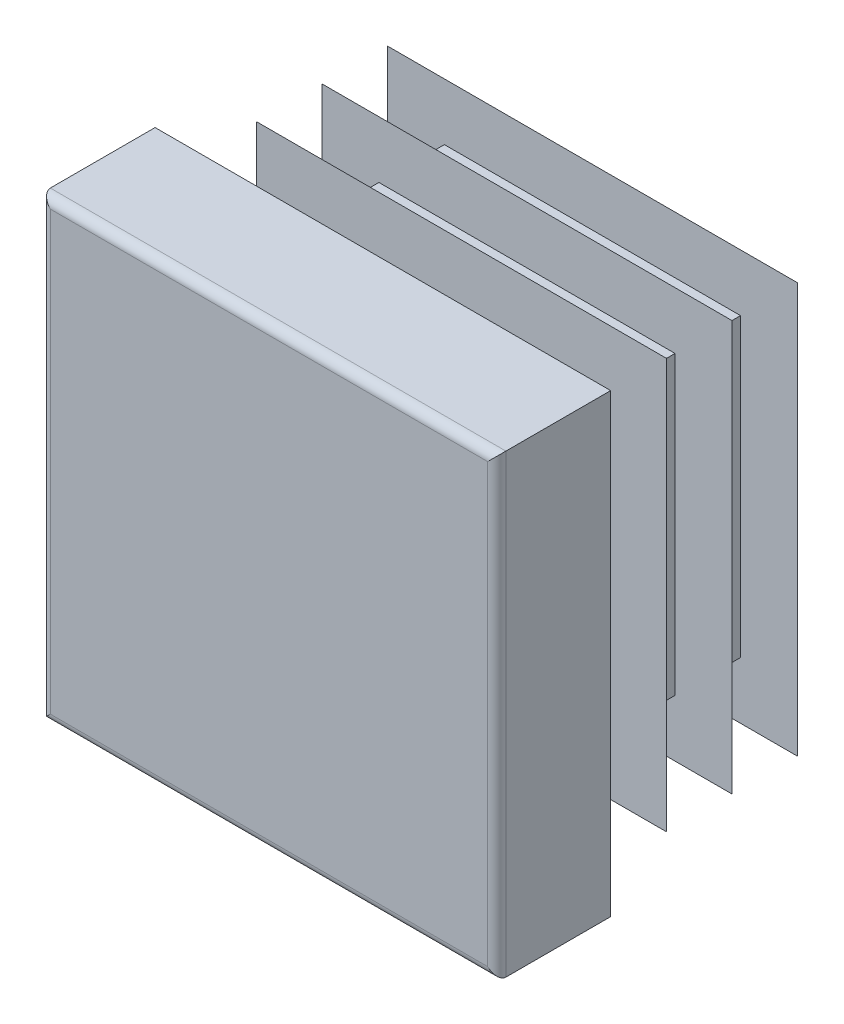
ISO-10303-21;
HEADER;
FILE_DESCRIPTION(('STEP AP214'),'2;1');
FILE_NAME('part.step','',(''),(''),'','','');
FILE_SCHEMA(('AUTOMOTIVE_DESIGN { 1 0 10303 214 1 1 1 1 }'));
ENDSEC;
DATA;
#1=APPLICATION_CONTEXT('core data for automotive mechanical design processes');
#2=APPLICATION_PROTOCOL_DEFINITION('international standard','automotive_design',2000,#1);
#3=PRODUCT_CONTEXT('',#1,'mechanical');
#4=PRODUCT('Part','Part','',(#3));
#5=PRODUCT_RELATED_PRODUCT_CATEGORY('part','',(#4));
#6=PRODUCT_DEFINITION_FORMATION('','',#4);
#7=PRODUCT_DEFINITION_CONTEXT('part definition',#1,'design');
#8=PRODUCT_DEFINITION('design','',#6,#7);
#9=PRODUCT_DEFINITION_SHAPE('','',#8);
#10=(LENGTH_UNIT() NAMED_UNIT(*) SI_UNIT(.MILLI.,.METRE.));
#11=(NAMED_UNIT(*) PLANE_ANGLE_UNIT() SI_UNIT($,.RADIAN.));
#12=(NAMED_UNIT(*) SI_UNIT($,.STERADIAN.) SOLID_ANGLE_UNIT());
#13=UNCERTAINTY_MEASURE_WITH_UNIT(LENGTH_MEASURE(1.E-05),#10,'distance_accuracy_value','');
#14=(GEOMETRIC_REPRESENTATION_CONTEXT(3) GLOBAL_UNCERTAINTY_ASSIGNED_CONTEXT((#13)) GLOBAL_UNIT_ASSIGNED_CONTEXT((#10,
#11,#12)) REPRESENTATION_CONTEXT('',''));
#15=CARTESIAN_POINT('',(0.,0.,0.));
#16=DIRECTION('',(0.,0.,1.));
#17=DIRECTION('',(1.,0.,0.));
#18=AXIS2_PLACEMENT_3D('',#15,#16,#17);
#19=CARTESIAN_POINT('',(9.6,-10.,5.));
#20=DIRECTION('',(0.,0.,-1.));
#21=DIRECTION('',(0.,1.,0.));
#22=AXIS2_PLACEMENT_3D('',#19,#20,#21);
#23=PLANE('',#22);
#24=DIRECTION('',(0.,1.,0.));
#25=VECTOR('',#24,1.);
#26=CARTESIAN_POINT('',(-9.6,-10.,5.));
#27=LINE('',#26,#25);
#28=CARTESIAN_POINT('',(-9.6,-9.6,5.));
#29=VERTEX_POINT('',#28);
#30=CARTESIAN_POINT('',(-9.6,9.6,5.));
#31=VERTEX_POINT('',#30);
#32=EDGE_CURVE('E262',#29,#31,#27,.T.);
#33=ORIENTED_EDGE('',*,*,#32,.F.);
#34=DIRECTION('',(-1.,0.,0.));
#35=VECTOR('',#34,1.);
#36=CARTESIAN_POINT('',(10.,-9.6,5.));
#37=LINE('',#36,#35);
#38=CARTESIAN_POINT('',(9.6,-9.6,5.));
#39=VERTEX_POINT('',#38);
#40=EDGE_CURVE('E432',#39,#29,#37,.T.);
#41=ORIENTED_EDGE('',*,*,#40,.F.);
#42=DIRECTION('',(0.,1.,0.));
#43=VECTOR('',#42,1.);
#44=CARTESIAN_POINT('',(9.6,-10.,5.));
#45=LINE('',#44,#43);
#46=CARTESIAN_POINT('',(9.6,9.6,5.));
#47=VERTEX_POINT('',#46);
#48=EDGE_CURVE('E257',#39,#47,#45,.T.);
#49=ORIENTED_EDGE('',*,*,#48,.T.);
#50=DIRECTION('',(-1.,0.,0.));
#51=VECTOR('',#50,1.);
#52=CARTESIAN_POINT('',(10.,9.6,5.));
#53=LINE('',#52,#51);
#54=EDGE_CURVE('E534',#47,#31,#53,.T.);
#55=ORIENTED_EDGE('',*,*,#54,.T.);
#56=EDGE_LOOP('',(#33,#41,#49,#55));
#57=FACE_BOUND('',#56,.T.);
#58=ADVANCED_FACE('F14',(#57),#23,.F.);
#59=CARTESIAN_POINT('',(-9.6,-10.,4.6));
#60=DIRECTION('',(0.,1.,0.));
#61=DIRECTION('',(-1.,0.,0.));
#62=AXIS2_PLACEMENT_3D('',#59,#60,#61);
#63=CYLINDRICAL_SURFACE('',#62,0.4);
#64=DIRECTION('',(0.,1.,0.));
#65=VECTOR('',#64,1.);
#66=CARTESIAN_POINT('',(-10.,-10.,4.6));
#67=LINE('',#66,#65);
#68=CARTESIAN_POINT('',(-10.,-10.,4.6));
#69=VERTEX_POINT('',#68);
#70=CARTESIAN_POINT('',(-10.,10.,4.6));
#71=VERTEX_POINT('',#70);
#72=EDGE_CURVE('E354',#69,#71,#67,.T.);
#73=ORIENTED_EDGE('',*,*,#72,.F.);
#74=CARTESIAN_POINT('',(-9.6,-9.6,4.6));
#75=DIRECTION('',(-0.707106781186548,0.707106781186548,0.));
#76=DIRECTION('',(0.707106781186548,0.707106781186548,0.));
#77=AXIS2_PLACEMENT_3D('',#74,#75,#76);
#78=ELLIPSE('',#77,0.565685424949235,0.4);
#79=EDGE_CURVE('E59',#69,#29,#78,.T.);
#80=ORIENTED_EDGE('',*,*,#79,.T.);
#81=ORIENTED_EDGE('',*,*,#32,.T.);
#82=CARTESIAN_POINT('',(-9.6,9.6,4.6));
#83=DIRECTION('',(0.707106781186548,0.707106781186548,0.));
#84=DIRECTION('',(-0.707106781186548,0.707106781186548,0.));
#85=AXIS2_PLACEMENT_3D('',#82,#83,#84);
#86=ELLIPSE('',#85,0.565685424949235,0.4);
#87=EDGE_CURVE('E258',#31,#71,#86,.F.);
#88=ORIENTED_EDGE('',*,*,#87,.T.);
#89=EDGE_LOOP('',(#73,#80,#81,#88));
#90=FACE_BOUND('',#89,.T.);
#91=ADVANCED_FACE('F16',(#90),#63,.T.);
#92=CARTESIAN_POINT('',(-10.,-10.,4.6));
#93=DIRECTION('',(1.,0.,0.));
#94=DIRECTION('',(0.,1.,0.));
#95=AXIS2_PLACEMENT_3D('',#92,#93,#94);
#96=PLANE('',#95);
#97=DIRECTION('',(0.,0.,-1.));
#98=VECTOR('',#97,1.);
#99=CARTESIAN_POINT('',(-10.,10.,4.6));
#100=LINE('',#99,#98);
#101=CARTESIAN_POINT('',(-10.,10.,0.));
#102=VERTEX_POINT('',#101);
#103=EDGE_CURVE('E519',#71,#102,#100,.T.);
#104=ORIENTED_EDGE('',*,*,#103,.T.);
#105=DIRECTION('',(0.,1.,0.));
#106=VECTOR('',#105,1.);
#107=CARTESIAN_POINT('',(-10.,-10.,0.));
#108=LINE('',#107,#106);
#109=CARTESIAN_POINT('',(-10.,-10.,0.));
#110=VERTEX_POINT('',#109);
#111=EDGE_CURVE('E352',#110,#102,#108,.T.);
#112=ORIENTED_EDGE('',*,*,#111,.F.);
#113=DIRECTION('',(0.,0.,-1.));
#114=VECTOR('',#113,1.);
#115=CARTESIAN_POINT('',(-10.,-10.,4.6));
#116=LINE('',#115,#114);
#117=EDGE_CURVE('E520',#69,#110,#116,.T.);
#118=ORIENTED_EDGE('',*,*,#117,.F.);
#119=ORIENTED_EDGE('',*,*,#72,.T.);
#120=EDGE_LOOP('',(#104,#112,#118,#119));
#121=FACE_BOUND('',#120,.T.);
#122=ADVANCED_FACE('F604',(#121),#96,.F.);
#123=CARTESIAN_POINT('',(-6.5,-10.,0.));
#124=DIRECTION('',(1.,0.,0.));
#125=DIRECTION('',(0.,1.,0.));
#126=AXIS2_PLACEMENT_3D('',#123,#124,#125);
#127=PLANE('',#126);
#128=DIRECTION('',(0.,1.,0.));
#129=VECTOR('',#128,1.);
#130=CARTESIAN_POINT('',(-6.5,-10.,0.));
#131=LINE('',#130,#129);
#132=CARTESIAN_POINT('',(-6.5,-6.5,0.));
#133=VERTEX_POINT('',#132);
#134=CARTESIAN_POINT('',(-6.5,6.5,0.));
#135=VERTEX_POINT('',#134);
#136=EDGE_CURVE('E349',#133,#135,#131,.T.);
#137=ORIENTED_EDGE('',*,*,#136,.T.);
#138=DIRECTION('',(0.,0.,-1.));
#139=VECTOR('',#138,1.);
#140=CARTESIAN_POINT('',(-6.5,6.5,0.));
#141=LINE('',#140,#139);
#142=CARTESIAN_POINT('',(-6.5,6.5,-0.575));
#143=VERTEX_POINT('',#142);
#144=EDGE_CURVE('E445',#135,#143,#141,.T.);
#145=ORIENTED_EDGE('',*,*,#144,.T.);
#146=DIRECTION('',(0.,1.,0.));
#147=VECTOR('',#146,1.);
#148=CARTESIAN_POINT('',(-6.5,-10.,-0.575));
#149=LINE('',#148,#147);
#150=CARTESIAN_POINT('',(-6.5,-6.5,-0.575));
#151=VERTEX_POINT('',#150);
#152=EDGE_CURVE('E346',#151,#143,#149,.T.);
#153=ORIENTED_EDGE('',*,*,#152,.F.);
#154=DIRECTION('',(0.,0.,1.));
#155=VECTOR('',#154,1.);
#156=CARTESIAN_POINT('',(-6.5,-6.5,0.));
#157=LINE('',#156,#155);
#158=EDGE_CURVE('E439',#151,#133,#157,.T.);
#159=ORIENTED_EDGE('',*,*,#158,.T.);
#160=EDGE_LOOP('',(#137,#145,#153,#159));
#161=FACE_BOUND('',#160,.T.);
#162=ADVANCED_FACE('F728',(#161),#127,.F.);
#163=CARTESIAN_POINT('',(-9.,-10.,-0.575));
#164=DIRECTION('',(0.573576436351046,0.,0.819152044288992));
#165=DIRECTION('',(-0.819152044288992,0.,0.573576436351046));
#166=AXIS2_PLACEMENT_3D('',#163,#164,#165);
#167=PLANE('',#166);
#168=DIRECTION('',(0.,1.,0.));
#169=VECTOR('',#168,1.);
#170=CARTESIAN_POINT('',(-9.,-10.,-0.575));
#171=LINE('',#170,#169);
#172=CARTESIAN_POINT('',(-9.,-9.,-0.575));
#173=VERTEX_POINT('',#172);
#174=CARTESIAN_POINT('',(-9.,9.,-0.575));
#175=VERTEX_POINT('',#174);
#176=EDGE_CURVE('E344',#173,#175,#171,.T.);
#177=ORIENTED_EDGE('',*,*,#176,.T.);
#178=DIRECTION('',(0.633687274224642,-0.633687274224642,-0.443712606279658));
#179=VECTOR('',#178,1.);
#180=CARTESIAN_POINT('',(-1.37036833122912,1.37036833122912,-5.9173256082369));
#181=LINE('',#180,#179);
#182=CARTESIAN_POINT('',(-6.5,6.5,-2.32551884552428));
#183=VERTEX_POINT('',#182);
#184=EDGE_CURVE('E457',#175,#183,#181,.T.);
#185=ORIENTED_EDGE('',*,*,#184,.T.);
#186=DIRECTION('',(0.,1.,0.));
#187=VECTOR('',#186,1.);
#188=CARTESIAN_POINT('',(-6.5,-10.,-2.32551884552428));
#189=LINE('',#188,#187);
#190=CARTESIAN_POINT('',(-6.5,-6.5,-2.32551884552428));
#191=VERTEX_POINT('',#190);
#192=EDGE_CURVE('E341',#191,#183,#189,.T.);
#193=ORIENTED_EDGE('',*,*,#192,.F.);
#194=DIRECTION('',(-0.633687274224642,-0.633687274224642,0.443712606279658));
#195=VECTOR('',#194,1.);
#196=CARTESIAN_POINT('',(-9.40155956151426,-9.40155956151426,-0.293824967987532));
#197=LINE('',#196,#195);
#198=EDGE_CURVE('E451',#191,#173,#197,.T.);
#199=ORIENTED_EDGE('',*,*,#198,.T.);
#200=EDGE_LOOP('',(#177,#185,#193,#199));
#201=FACE_BOUND('',#200,.T.);
#202=ADVANCED_FACE('F732',(#201),#167,.F.);
#203=CARTESIAN_POINT('',(-6.5,-10.,-2.32551884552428));
#204=DIRECTION('',(1.,0.,0.));
#205=DIRECTION('',(0.,1.,0.));
#206=AXIS2_PLACEMENT_3D('',#203,#204,#205);
#207=PLANE('',#206);
#208=ORIENTED_EDGE('',*,*,#192,.T.);
#209=DIRECTION('',(0.,0.,-1.));
#210=VECTOR('',#209,1.);
#211=CARTESIAN_POINT('',(-6.5,6.5,-2.32551884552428));
#212=LINE('',#211,#210);
#213=CARTESIAN_POINT('',(-6.5,6.5,-3.45));
#214=VERTEX_POINT('',#213);
#215=EDGE_CURVE('E463',#183,#214,#212,.T.);
#216=ORIENTED_EDGE('',*,*,#215,.T.);
#217=DIRECTION('',(0.,1.,0.));
#218=VECTOR('',#217,1.);
#219=CARTESIAN_POINT('',(-6.5,-10.,-3.45));
#220=LINE('',#219,#218);
#221=CARTESIAN_POINT('',(-6.5,-6.5,-3.45));
#222=VERTEX_POINT('',#221);
#223=EDGE_CURVE('E338',#222,#214,#220,.T.);
#224=ORIENTED_EDGE('',*,*,#223,.F.);
#225=DIRECTION('',(0.,0.,1.));
#226=VECTOR('',#225,1.);
#227=CARTESIAN_POINT('',(-6.5,-6.5,-2.32551884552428));
#228=LINE('',#227,#226);
#229=EDGE_CURVE('E460',#222,#191,#228,.T.);
#230=ORIENTED_EDGE('',*,*,#229,.T.);
#231=EDGE_LOOP('',(#208,#216,#224,#230));
#232=FACE_BOUND('',#231,.T.);
#233=ADVANCED_FACE('F738',(#232),#207,.F.);
#234=CARTESIAN_POINT('',(-9.,-10.,-3.45));
#235=DIRECTION('',(0.573576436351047,0.,0.819152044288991));
#236=DIRECTION('',(-0.819152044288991,0.,0.573576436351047));
#237=AXIS2_PLACEMENT_3D('',#234,#235,#236);
#238=PLANE('',#237);
#239=DIRECTION('',(0.,1.,0.));
#240=VECTOR('',#239,1.);
#241=CARTESIAN_POINT('',(-9.,-10.,-3.45));
#242=LINE('',#241,#240);
#243=CARTESIAN_POINT('',(-9.,-9.,-3.45));
#244=VERTEX_POINT('',#243);
#245=CARTESIAN_POINT('',(-9.,9.,-3.45));
#246=VERTEX_POINT('',#245);
#247=EDGE_CURVE('E336',#244,#246,#242,.T.);
#248=ORIENTED_EDGE('',*,*,#247,.T.);
#249=DIRECTION('',(0.633687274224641,-0.633687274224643,-0.443712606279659));
#250=VECTOR('',#249,1.);
#251=CARTESIAN_POINT('',(-1.37036833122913,1.37036833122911,-8.79232560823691));
#252=LINE('',#251,#250);
#253=CARTESIAN_POINT('',(-6.5,6.5,-5.20051884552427));
#254=VERTEX_POINT('',#253);
#255=EDGE_CURVE('E475',#246,#254,#252,.T.);
#256=ORIENTED_EDGE('',*,*,#255,.T.);
#257=DIRECTION('',(0.,1.,0.));
#258=VECTOR('',#257,1.);
#259=CARTESIAN_POINT('',(-6.5,-10.,-5.20051884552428));
#260=LINE('',#259,#258);
#261=CARTESIAN_POINT('',(-6.5,-6.5,-5.20051884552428));
#262=VERTEX_POINT('',#261);
#263=EDGE_CURVE('E333',#262,#254,#260,.T.);
#264=ORIENTED_EDGE('',*,*,#263,.F.);
#265=DIRECTION('',(-0.633687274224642,-0.633687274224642,0.443712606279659));
#266=VECTOR('',#265,1.);
#267=CARTESIAN_POINT('',(-9.40155956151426,-9.40155956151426,-3.16882496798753));
#268=LINE('',#267,#266);
#269=EDGE_CURVE('E469',#262,#244,#268,.T.);
#270=ORIENTED_EDGE('',*,*,#269,.T.);
#271=EDGE_LOOP('',(#248,#256,#264,#270));
#272=FACE_BOUND('',#271,.T.);
#273=ADVANCED_FACE('F742',(#272),#238,.F.);
#274=CARTESIAN_POINT('',(-6.5,-10.,-5.20051884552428));
#275=DIRECTION('',(1.,0.,0.));
#276=DIRECTION('',(0.,1.,0.));
#277=AXIS2_PLACEMENT_3D('',#274,#275,#276);
#278=PLANE('',#277);
#279=ORIENTED_EDGE('',*,*,#263,.T.);
#280=DIRECTION('',(0.,0.,-1.));
#281=VECTOR('',#280,1.);
#282=CARTESIAN_POINT('',(-6.5,6.5,-5.20051884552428));
#283=LINE('',#282,#281);
#284=CARTESIAN_POINT('',(-6.5,6.5,-6.325));
#285=VERTEX_POINT('',#284);
#286=EDGE_CURVE('E481',#254,#285,#283,.T.);
#287=ORIENTED_EDGE('',*,*,#286,.T.);
#288=DIRECTION('',(0.,1.,0.));
#289=VECTOR('',#288,1.);
#290=CARTESIAN_POINT('',(-6.5,-10.,-6.325));
#291=LINE('',#290,#289);
#292=CARTESIAN_POINT('',(-6.5,-6.5,-6.325));
#293=VERTEX_POINT('',#292);
#294=EDGE_CURVE('E330',#293,#285,#291,.T.);
#295=ORIENTED_EDGE('',*,*,#294,.F.);
#296=DIRECTION('',(0.,0.,1.));
#297=VECTOR('',#296,1.);
#298=CARTESIAN_POINT('',(-6.5,-6.5,-5.20051884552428));
#299=LINE('',#298,#297);
#300=EDGE_CURVE('E478',#293,#262,#299,.T.);
#301=ORIENTED_EDGE('',*,*,#300,.T.);
#302=EDGE_LOOP('',(#279,#287,#295,#301));
#303=FACE_BOUND('',#302,.T.);
#304=ADVANCED_FACE('F746',(#303),#278,.F.);
#305=CARTESIAN_POINT('',(-9.,-10.,-6.325));
#306=DIRECTION('',(0.573576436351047,0.,0.819152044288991));
#307=DIRECTION('',(-0.819152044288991,0.,0.573576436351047));
#308=AXIS2_PLACEMENT_3D('',#305,#306,#307);
#309=PLANE('',#308);
#310=DIRECTION('',(0.,1.,0.));
#311=VECTOR('',#310,1.);
#312=CARTESIAN_POINT('',(-9.,-10.,-6.325));
#313=LINE('',#312,#311);
#314=CARTESIAN_POINT('',(-9.,-9.,-6.325));
#315=VERTEX_POINT('',#314);
#316=CARTESIAN_POINT('',(-9.,9.,-6.325));
#317=VERTEX_POINT('',#316);
#318=EDGE_CURVE('E328',#315,#317,#313,.T.);
#319=ORIENTED_EDGE('',*,*,#318,.T.);
#320=DIRECTION('',(0.633687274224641,-0.633687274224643,-0.443712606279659));
#321=VECTOR('',#320,1.);
#322=CARTESIAN_POINT('',(-1.37036833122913,1.37036833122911,-11.6673256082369));
#323=LINE('',#322,#321);
#324=CARTESIAN_POINT('',(-6.5,6.5,-8.07551884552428));
#325=VERTEX_POINT('',#324);
#326=EDGE_CURVE('E493',#317,#325,#323,.T.);
#327=ORIENTED_EDGE('',*,*,#326,.T.);
#328=DIRECTION('',(0.,1.,0.));
#329=VECTOR('',#328,1.);
#330=CARTESIAN_POINT('',(-6.5,-10.,-8.07551884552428));
#331=LINE('',#330,#329);
#332=CARTESIAN_POINT('',(-6.5,-6.5,-8.07551884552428));
#333=VERTEX_POINT('',#332);
#334=EDGE_CURVE('E325',#333,#325,#331,.T.);
#335=ORIENTED_EDGE('',*,*,#334,.F.);
#336=DIRECTION('',(-0.633687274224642,-0.633687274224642,0.443712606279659));
#337=VECTOR('',#336,1.);
#338=CARTESIAN_POINT('',(-9.40155956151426,-9.40155956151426,-6.04382496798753));
#339=LINE('',#338,#337);
#340=EDGE_CURVE('E487',#333,#315,#339,.T.);
#341=ORIENTED_EDGE('',*,*,#340,.T.);
#342=EDGE_LOOP('',(#319,#327,#335,#341));
#343=FACE_BOUND('',#342,.T.);
#344=ADVANCED_FACE('F668',(#343),#309,.F.);
#345=CARTESIAN_POINT('',(-6.5,-10.,-8.07551884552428));
#346=DIRECTION('',(1.,0.,0.));
#347=DIRECTION('',(0.,1.,0.));
#348=AXIS2_PLACEMENT_3D('',#345,#346,#347);
#349=PLANE('',#348);
#350=ORIENTED_EDGE('',*,*,#334,.T.);
#351=DIRECTION('',(0.,0.,-1.));
#352=VECTOR('',#351,1.);
#353=CARTESIAN_POINT('',(-6.5,6.5,-8.07551884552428));
#354=LINE('',#353,#352);
#355=CARTESIAN_POINT('',(-6.5,6.5,-9.2));
#356=VERTEX_POINT('',#355);
#357=EDGE_CURVE('E499',#325,#356,#354,.T.);
#358=ORIENTED_EDGE('',*,*,#357,.T.);
#359=DIRECTION('',(0.,1.,0.));
#360=VECTOR('',#359,1.);
#361=CARTESIAN_POINT('',(-6.5,-10.,-9.2));
#362=LINE('',#361,#360);
#363=CARTESIAN_POINT('',(-6.5,-6.5,-9.2));
#364=VERTEX_POINT('',#363);
#365=EDGE_CURVE('E322',#364,#356,#362,.T.);
#366=ORIENTED_EDGE('',*,*,#365,.F.);
#367=DIRECTION('',(0.,0.,1.));
#368=VECTOR('',#367,1.);
#369=CARTESIAN_POINT('',(-6.5,-6.5,-8.07551884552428));
#370=LINE('',#369,#368);
#371=EDGE_CURVE('E496',#364,#333,#370,.T.);
#372=ORIENTED_EDGE('',*,*,#371,.T.);
#373=EDGE_LOOP('',(#350,#358,#366,#372));
#374=FACE_BOUND('',#373,.T.);
#375=ADVANCED_FACE('F665',(#374),#349,.F.);
#376=CARTESIAN_POINT('',(-9.,-10.,-9.2));
#377=DIRECTION('',(0.573576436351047,0.,0.819152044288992));
#378=DIRECTION('',(-0.819152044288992,0.,0.573576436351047));
#379=AXIS2_PLACEMENT_3D('',#376,#377,#378);
#380=PLANE('',#379);
#381=DIRECTION('',(0.,1.,0.));
#382=VECTOR('',#381,1.);
#383=CARTESIAN_POINT('',(-9.,-10.,-9.2));
#384=LINE('',#383,#382);
#385=CARTESIAN_POINT('',(-9.,-9.,-9.2));
#386=VERTEX_POINT('',#385);
#387=CARTESIAN_POINT('',(-9.,9.,-9.2));
#388=VERTEX_POINT('',#387);
#389=EDGE_CURVE('E320',#386,#388,#384,.T.);
#390=ORIENTED_EDGE('',*,*,#389,.T.);
#391=DIRECTION('',(0.633687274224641,-0.633687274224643,-0.443712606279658));
#392=VECTOR('',#391,1.);
#393=CARTESIAN_POINT('',(-1.37036833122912,1.37036833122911,-14.5423256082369));
#394=LINE('',#393,#392);
#395=CARTESIAN_POINT('',(-6.5,6.5,-10.9505188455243));
#396=VERTEX_POINT('',#395);
#397=EDGE_CURVE('E511',#388,#396,#394,.T.);
#398=ORIENTED_EDGE('',*,*,#397,.T.);
#399=DIRECTION('',(0.,1.,0.));
#400=VECTOR('',#399,1.);
#401=CARTESIAN_POINT('',(-6.5,-10.,-10.9505188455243));
#402=LINE('',#401,#400);
#403=CARTESIAN_POINT('',(-6.5,-6.5,-10.9505188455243));
#404=VERTEX_POINT('',#403);
#405=EDGE_CURVE('E317',#404,#396,#402,.T.);
#406=ORIENTED_EDGE('',*,*,#405,.F.);
#407=DIRECTION('',(-0.633687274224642,-0.633687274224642,0.443712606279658));
#408=VECTOR('',#407,1.);
#409=CARTESIAN_POINT('',(-9.40155956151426,-9.40155956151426,-8.91882496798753));
#410=LINE('',#409,#408);
#411=EDGE_CURVE('E505',#404,#386,#410,.T.);
#412=ORIENTED_EDGE('',*,*,#411,.T.);
#413=EDGE_LOOP('',(#390,#398,#406,#412));
#414=FACE_BOUND('',#413,.T.);
#415=ADVANCED_FACE('F580',(#414),#380,.F.);
#416=CARTESIAN_POINT('',(-6.5,-10.,-10.9505188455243));
#417=DIRECTION('',(1.,0.,0.));
#418=DIRECTION('',(0.,1.,0.));
#419=AXIS2_PLACEMENT_3D('',#416,#417,#418);
#420=PLANE('',#419);
#421=ORIENTED_EDGE('',*,*,#405,.T.);
#422=DIRECTION('',(0.,0.,-1.));
#423=VECTOR('',#422,1.);
#424=CARTESIAN_POINT('',(-6.5,6.5,-10.9505188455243));
#425=LINE('',#424,#423);
#426=CARTESIAN_POINT('',(-6.5,6.5,-11.5));
#427=VERTEX_POINT('',#426);
#428=EDGE_CURVE('E517',#396,#427,#425,.T.);
#429=ORIENTED_EDGE('',*,*,#428,.T.);
#430=DIRECTION('',(0.,1.,0.));
#431=VECTOR('',#430,1.);
#432=CARTESIAN_POINT('',(-6.5,-10.,-11.5));
#433=LINE('',#432,#431);
#434=CARTESIAN_POINT('',(-6.5,-6.5,-11.5));
#435=VERTEX_POINT('',#434);
#436=EDGE_CURVE('E314',#435,#427,#433,.T.);
#437=ORIENTED_EDGE('',*,*,#436,.F.);
#438=DIRECTION('',(0.,0.,1.));
#439=VECTOR('',#438,1.);
#440=CARTESIAN_POINT('',(-6.5,-6.5,-10.9505188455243));
#441=LINE('',#440,#439);
#442=EDGE_CURVE('E514',#435,#404,#441,.T.);
#443=ORIENTED_EDGE('',*,*,#442,.T.);
#444=EDGE_LOOP('',(#421,#429,#437,#443));
#445=FACE_BOUND('',#444,.T.);
#446=ADVANCED_FACE('F582',(#445),#420,.F.);
#447=CARTESIAN_POINT('',(-6.5,-10.,-11.5));
#448=DIRECTION('',(0.,0.,1.));
#449=DIRECTION('',(0.,-1.,0.));
#450=AXIS2_PLACEMENT_3D('',#447,#448,#449);
#451=PLANE('',#450);
#452=ORIENTED_EDGE('',*,*,#436,.T.);
#453=DIRECTION('',(-1.,0.,0.));
#454=VECTOR('',#453,1.);
#455=CARTESIAN_POINT('',(10.,6.5,-11.5));
#456=LINE('',#455,#454);
#457=CARTESIAN_POINT('',(6.5,6.5,-11.5));
#458=VERTEX_POINT('',#457);
#459=EDGE_CURVE('E388',#458,#427,#456,.T.);
#460=ORIENTED_EDGE('',*,*,#459,.F.);
#461=DIRECTION('',(0.,1.,0.));
#462=VECTOR('',#461,1.);
#463=CARTESIAN_POINT('',(6.5,-10.,-11.5));
#464=LINE('',#463,#462);
#465=CARTESIAN_POINT('',(6.5,-6.5,-11.5));
#466=VERTEX_POINT('',#465);
#467=EDGE_CURVE('E311',#466,#458,#464,.T.);
#468=ORIENTED_EDGE('',*,*,#467,.F.);
#469=DIRECTION('',(-1.,0.,0.));
#470=VECTOR('',#469,1.);
#471=CARTESIAN_POINT('',(10.,-6.5,-11.5));
#472=LINE('',#471,#470);
#473=EDGE_CURVE('E386',#466,#435,#472,.T.);
#474=ORIENTED_EDGE('',*,*,#473,.T.);
#475=EDGE_LOOP('',(#452,#460,#468,#474));
#476=FACE_BOUND('',#475,.T.);
#477=ADVANCED_FACE('F385',(#476),#451,.F.);
#478=CARTESIAN_POINT('',(6.5,-10.,-11.5));
#479=DIRECTION('',(-1.,0.,0.));
#480=DIRECTION('',(0.,-1.,0.));
#481=AXIS2_PLACEMENT_3D('',#478,#479,#480);
#482=PLANE('',#481);
#483=ORIENTED_EDGE('',*,*,#467,.T.);
#484=DIRECTION('',(0.,0.,1.));
#485=VECTOR('',#484,1.);
#486=CARTESIAN_POINT('',(6.5,6.5,-11.5));
#487=LINE('',#486,#485);
#488=CARTESIAN_POINT('',(6.5,6.5,-10.9505188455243));
#489=VERTEX_POINT('',#488);
#490=EDGE_CURVE('E9',#458,#489,#487,.T.);
#491=ORIENTED_EDGE('',*,*,#490,.T.);
#492=DIRECTION('',(0.,1.,0.));
#493=VECTOR('',#492,1.);
#494=CARTESIAN_POINT('',(6.5,-10.,-10.9505188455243));
#495=LINE('',#494,#493);
#496=CARTESIAN_POINT('',(6.5,-6.5,-10.9505188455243));
#497=VERTEX_POINT('',#496);
#498=EDGE_CURVE('E308',#497,#489,#495,.T.);
#499=ORIENTED_EDGE('',*,*,#498,.F.);
#500=DIRECTION('',(0.,0.,-1.));
#501=VECTOR('',#500,1.);
#502=CARTESIAN_POINT('',(6.5,-6.5,-11.5));
#503=LINE('',#502,#501);
#504=EDGE_CURVE('E23',#497,#466,#503,.T.);
#505=ORIENTED_EDGE('',*,*,#504,.T.);
#506=EDGE_LOOP('',(#483,#491,#499,#505));
#507=FACE_BOUND('',#506,.T.);
#508=ADVANCED_FACE('F378',(#507),#482,.F.);
#509=CARTESIAN_POINT('',(6.5,-10.,-10.9505188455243));
#510=DIRECTION('',(-0.573576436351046,0.,0.819152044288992));
#511=DIRECTION('',(-0.819152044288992,0.,-0.573576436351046));
#512=AXIS2_PLACEMENT_3D('',#509,#510,#511);
#513=PLANE('',#512);
#514=ORIENTED_EDGE('',*,*,#498,.T.);
#515=DIRECTION('',(0.633687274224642,0.633687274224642,0.443712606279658));
#516=VECTOR('',#515,1.);
#517=CARTESIAN_POINT('',(-0.125732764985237,-0.125732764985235,-15.58990687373));
#518=LINE('',#517,#516);
#519=CARTESIAN_POINT('',(9.,9.,-9.2));
#520=VERTEX_POINT('',#519);
#521=EDGE_CURVE('E508',#489,#520,#518,.T.);
#522=ORIENTED_EDGE('',*,*,#521,.T.);
#523=DIRECTION('',(0.,1.,0.));
#524=VECTOR('',#523,1.);
#525=CARTESIAN_POINT('',(9.,-10.,-9.2));
#526=LINE('',#525,#524);
#527=CARTESIAN_POINT('',(9.,-9.,-9.2));
#528=VERTEX_POINT('',#527);
#529=EDGE_CURVE('E305',#528,#520,#526,.T.);
#530=ORIENTED_EDGE('',*,*,#529,.F.);
#531=DIRECTION('',(-0.633687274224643,0.633687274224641,-0.443712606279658));
#532=VECTOR('',#531,1.);
#533=CARTESIAN_POINT('',(7.9054584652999,-7.9054584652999,-9.96640623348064));
#534=LINE('',#533,#532);
#535=EDGE_CURVE('E502',#528,#497,#534,.T.);
#536=ORIENTED_EDGE('',*,*,#535,.T.);
#537=EDGE_LOOP('',(#514,#522,#530,#536));
#538=FACE_BOUND('',#537,.T.);
#539=ADVANCED_FACE('F588',(#538),#513,.F.);
#540=CARTESIAN_POINT('',(9.,-10.,-9.2));
#541=DIRECTION('',(0.,0.,-1.));
#542=DIRECTION('',(0.,1.,0.));
#543=AXIS2_PLACEMENT_3D('',#540,#541,#542);
#544=PLANE('',#543);
#545=ORIENTED_EDGE('',*,*,#529,.T.);
#546=DIRECTION('',(-1.,0.,0.));
#547=VECTOR('',#546,1.);
#548=CARTESIAN_POINT('',(10.,9.,-9.2));
#549=LINE('',#548,#547);
#550=EDGE_CURVE('E394',#520,#388,#549,.T.);
#551=ORIENTED_EDGE('',*,*,#550,.T.);
#552=ORIENTED_EDGE('',*,*,#389,.F.);
#553=DIRECTION('',(-1.,0.,0.));
#554=VECTOR('',#553,1.);
#555=CARTESIAN_POINT('',(10.,-9.,-9.2));
#556=LINE('',#555,#554);
#557=EDGE_CURVE('E401',#528,#386,#556,.T.);
#558=ORIENTED_EDGE('',*,*,#557,.F.);
#559=EDGE_LOOP('',(#545,#551,#552,#558));
#560=FACE_BOUND('',#559,.T.);
#561=ORIENTED_EDGE('',*,*,#365,.T.);
#562=DIRECTION('',(-1.,0.,0.));
#563=VECTOR('',#562,1.);
#564=CARTESIAN_POINT('',(10.,6.5,-9.2));
#565=LINE('',#564,#563);
#566=CARTESIAN_POINT('',(6.5,6.5,-9.2));
#567=VERTEX_POINT('',#566);
#568=EDGE_CURVE('E567',#567,#356,#565,.T.);
#569=ORIENTED_EDGE('',*,*,#568,.F.);
#570=DIRECTION('',(0.,1.,0.));
#571=VECTOR('',#570,1.);
#572=CARTESIAN_POINT('',(6.5,-10.,-9.2));
#573=LINE('',#572,#571);
#574=CARTESIAN_POINT('',(6.5,-6.5,-9.2));
#575=VERTEX_POINT('',#574);
#576=EDGE_CURVE('E302',#575,#567,#573,.T.);
#577=ORIENTED_EDGE('',*,*,#576,.F.);
#578=DIRECTION('',(-1.,0.,0.));
#579=VECTOR('',#578,1.);
#580=CARTESIAN_POINT('',(10.,-6.5,-9.2));
#581=LINE('',#580,#579);
#582=EDGE_CURVE('E403',#575,#364,#581,.T.);
#583=ORIENTED_EDGE('',*,*,#582,.T.);
#584=EDGE_LOOP('',(#561,#569,#577,#583));
#585=FACE_BOUND('',#584,.T.);
#586=ADVANCED_FACE('F571',(#560,#585),#544,.F.);
#587=CARTESIAN_POINT('',(6.5,-10.,-9.2));
#588=DIRECTION('',(-1.,0.,0.));
#589=DIRECTION('',(0.,-1.,0.));
#590=AXIS2_PLACEMENT_3D('',#587,#588,#589);
#591=PLANE('',#590);
#592=ORIENTED_EDGE('',*,*,#576,.T.);
#593=DIRECTION('',(0.,0.,1.));
#594=VECTOR('',#593,1.);
#595=CARTESIAN_POINT('',(6.5,6.5,-9.2));
#596=LINE('',#595,#594);
#597=CARTESIAN_POINT('',(6.5,6.5,-8.07551884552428));
#598=VERTEX_POINT('',#597);
#599=EDGE_CURVE('E372',#567,#598,#596,.T.);
#600=ORIENTED_EDGE('',*,*,#599,.T.);
#601=DIRECTION('',(0.,1.,0.));
#602=VECTOR('',#601,1.);
#603=CARTESIAN_POINT('',(6.5,-10.,-8.07551884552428));
#604=LINE('',#603,#602);
#605=CARTESIAN_POINT('',(6.5,-6.5,-8.07551884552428));
#606=VERTEX_POINT('',#605);
#607=EDGE_CURVE('E299',#606,#598,#604,.T.);
#608=ORIENTED_EDGE('',*,*,#607,.F.);
#609=DIRECTION('',(0.,0.,-1.));
#610=VECTOR('',#609,1.);
#611=CARTESIAN_POINT('',(6.5,-6.5,-9.2));
#612=LINE('',#611,#610);
#613=EDGE_CURVE('E369',#606,#575,#612,.T.);
#614=ORIENTED_EDGE('',*,*,#613,.T.);
#615=EDGE_LOOP('',(#592,#600,#608,#614));
#616=FACE_BOUND('',#615,.T.);
#617=ADVANCED_FACE('F596',(#616),#591,.F.);
#618=CARTESIAN_POINT('',(6.5,-10.,-8.07551884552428));
#619=DIRECTION('',(-0.573576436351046,0.,0.819152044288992));
#620=DIRECTION('',(-0.819152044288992,0.,-0.573576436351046));
#621=AXIS2_PLACEMENT_3D('',#618,#619,#620);
#622=PLANE('',#621);
#623=ORIENTED_EDGE('',*,*,#607,.T.);
#624=DIRECTION('',(0.633687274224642,0.633687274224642,0.443712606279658));
#625=VECTOR('',#624,1.);
#626=CARTESIAN_POINT('',(-0.125732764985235,-0.125732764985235,-12.71490687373));
#627=LINE('',#626,#625);
#628=CARTESIAN_POINT('',(9.,9.,-6.325));
#629=VERTEX_POINT('',#628);
#630=EDGE_CURVE('E490',#598,#629,#627,.T.);
#631=ORIENTED_EDGE('',*,*,#630,.T.);
#632=DIRECTION('',(0.,1.,0.));
#633=VECTOR('',#632,1.);
#634=CARTESIAN_POINT('',(9.,-10.,-6.325));
#635=LINE('',#634,#633);
#636=CARTESIAN_POINT('',(9.,-9.,-6.325));
#637=VERTEX_POINT('',#636);
#638=EDGE_CURVE('E296',#637,#629,#635,.T.);
#639=ORIENTED_EDGE('',*,*,#638,.F.);
#640=DIRECTION('',(-0.633687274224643,0.633687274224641,-0.443712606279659));
#641=VECTOR('',#640,1.);
#642=CARTESIAN_POINT('',(7.9054584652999,-7.9054584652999,-7.09140623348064));
#643=LINE('',#642,#641);
#644=EDGE_CURVE('E484',#637,#606,#643,.T.);
#645=ORIENTED_EDGE('',*,*,#644,.T.);
#646=EDGE_LOOP('',(#623,#631,#639,#645));
#647=FACE_BOUND('',#646,.T.);
#648=ADVANCED_FACE('F648',(#647),#622,.F.);
#649=CARTESIAN_POINT('',(9.,-10.,-6.325));
#650=DIRECTION('',(0.,0.,-1.));
#651=DIRECTION('',(0.,1.,0.));
#652=AXIS2_PLACEMENT_3D('',#649,#650,#651);
#653=PLANE('',#652);
#654=ORIENTED_EDGE('',*,*,#638,.T.);
#655=DIRECTION('',(-1.,0.,0.));
#656=VECTOR('',#655,1.);
#657=CARTESIAN_POINT('',(10.,9.,-6.325));
#658=LINE('',#657,#656);
#659=EDGE_CURVE('E561',#629,#317,#658,.T.);
#660=ORIENTED_EDGE('',*,*,#659,.T.);
#661=ORIENTED_EDGE('',*,*,#318,.F.);
#662=DIRECTION('',(-1.,0.,0.));
#663=VECTOR('',#662,1.);
#664=CARTESIAN_POINT('',(10.,-9.,-6.325));
#665=LINE('',#664,#663);
#666=EDGE_CURVE('E409',#637,#315,#665,.T.);
#667=ORIENTED_EDGE('',*,*,#666,.F.);
#668=EDGE_LOOP('',(#654,#660,#661,#667));
#669=FACE_BOUND('',#668,.T.);
#670=ORIENTED_EDGE('',*,*,#294,.T.);
#671=DIRECTION('',(-1.,0.,0.));
#672=VECTOR('',#671,1.);
#673=CARTESIAN_POINT('',(10.,6.5,-6.325));
#674=LINE('',#673,#672);
#675=CARTESIAN_POINT('',(6.5,6.5,-6.325));
#676=VERTEX_POINT('',#675);
#677=EDGE_CURVE('E559',#676,#285,#674,.T.);
#678=ORIENTED_EDGE('',*,*,#677,.F.);
#679=DIRECTION('',(0.,1.,0.));
#680=VECTOR('',#679,1.);
#681=CARTESIAN_POINT('',(6.5,-10.,-6.325));
#682=LINE('',#681,#680);
#683=CARTESIAN_POINT('',(6.5,-6.5,-6.325));
#684=VERTEX_POINT('',#683);
#685=EDGE_CURVE('E293',#684,#676,#682,.T.);
#686=ORIENTED_EDGE('',*,*,#685,.F.);
#687=DIRECTION('',(-1.,0.,0.));
#688=VECTOR('',#687,1.);
#689=CARTESIAN_POINT('',(10.,-6.5,-6.325));
#690=LINE('',#689,#688);
#691=EDGE_CURVE('E411',#684,#293,#690,.T.);
#692=ORIENTED_EDGE('',*,*,#691,.T.);
#693=EDGE_LOOP('',(#670,#678,#686,#692));
#694=FACE_BOUND('',#693,.T.);
#695=ADVANCED_FACE('F644',(#669,#694),#653,.F.);
#696=CARTESIAN_POINT('',(6.5,-10.,-6.325));
#697=DIRECTION('',(-1.,0.,0.));
#698=DIRECTION('',(0.,-1.,0.));
#699=AXIS2_PLACEMENT_3D('',#696,#697,#698);
#700=PLANE('',#699);
#701=ORIENTED_EDGE('',*,*,#685,.T.);
#702=DIRECTION('',(0.,0.,1.));
#703=VECTOR('',#702,1.);
#704=CARTESIAN_POINT('',(6.5,6.5,-6.325));
#705=LINE('',#704,#703);
#706=CARTESIAN_POINT('',(6.5,6.5,-5.20051884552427));
#707=VERTEX_POINT('',#706);
#708=EDGE_CURVE('E366',#676,#707,#705,.T.);
#709=ORIENTED_EDGE('',*,*,#708,.T.);
#710=DIRECTION('',(0.,1.,0.));
#711=VECTOR('',#710,1.);
#712=CARTESIAN_POINT('',(6.5,-10.,-5.20051884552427));
#713=LINE('',#712,#711);
#714=CARTESIAN_POINT('',(6.5,-6.5,-5.20051884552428));
#715=VERTEX_POINT('',#714);
#716=EDGE_CURVE('E290',#715,#707,#713,.T.);
#717=ORIENTED_EDGE('',*,*,#716,.F.);
#718=DIRECTION('',(0.,0.,-1.));
#719=VECTOR('',#718,1.);
#720=CARTESIAN_POINT('',(6.5,-6.5,-6.325));
#721=LINE('',#720,#719);
#722=EDGE_CURVE('E363',#715,#684,#721,.T.);
#723=ORIENTED_EDGE('',*,*,#722,.T.);
#724=EDGE_LOOP('',(#701,#709,#717,#723));
#725=FACE_BOUND('',#724,.T.);
#726=ADVANCED_FACE('F640',(#725),#700,.F.);
#727=CARTESIAN_POINT('',(6.5,-10.,-5.20051884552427));
#728=DIRECTION('',(-0.573576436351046,0.,0.819152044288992));
#729=DIRECTION('',(-0.819152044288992,0.,-0.573576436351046));
#730=AXIS2_PLACEMENT_3D('',#727,#728,#729);
#731=PLANE('',#730);
#732=ORIENTED_EDGE('',*,*,#716,.T.);
#733=DIRECTION('',(0.633687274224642,0.633687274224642,0.443712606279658));
#734=VECTOR('',#733,1.);
#735=CARTESIAN_POINT('',(-0.125732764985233,-0.125732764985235,-9.83990687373));
#736=LINE('',#735,#734);
#737=CARTESIAN_POINT('',(9.,9.,-3.45));
#738=VERTEX_POINT('',#737);
#739=EDGE_CURVE('E472',#707,#738,#736,.T.);
#740=ORIENTED_EDGE('',*,*,#739,.T.);
#741=DIRECTION('',(0.,1.,0.));
#742=VECTOR('',#741,1.);
#743=CARTESIAN_POINT('',(9.,-10.,-3.45));
#744=LINE('',#743,#742);
#745=CARTESIAN_POINT('',(9.,-9.,-3.45));
#746=VERTEX_POINT('',#745);
#747=EDGE_CURVE('E287',#746,#738,#744,.T.);
#748=ORIENTED_EDGE('',*,*,#747,.F.);
#749=DIRECTION('',(-0.633687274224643,0.633687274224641,-0.443712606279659));
#750=VECTOR('',#749,1.);
#751=CARTESIAN_POINT('',(7.9054584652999,-7.9054584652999,-4.21640623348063));
#752=LINE('',#751,#750);
#753=EDGE_CURVE('E466',#746,#715,#752,.T.);
#754=ORIENTED_EDGE('',*,*,#753,.T.);
#755=EDGE_LOOP('',(#732,#740,#748,#754));
#756=FACE_BOUND('',#755,.T.);
#757=ADVANCED_FACE('F636',(#756),#731,.F.);
#758=CARTESIAN_POINT('',(9.,-10.,-3.45));
#759=DIRECTION('',(0.,0.,-1.));
#760=DIRECTION('',(0.,1.,0.));
#761=AXIS2_PLACEMENT_3D('',#758,#759,#760);
#762=PLANE('',#761);
#763=ORIENTED_EDGE('',*,*,#747,.T.);
#764=DIRECTION('',(-1.,0.,0.));
#765=VECTOR('',#764,1.);
#766=CARTESIAN_POINT('',(10.,9.,-3.45));
#767=LINE('',#766,#765);
#768=EDGE_CURVE('E553',#738,#246,#767,.T.);
#769=ORIENTED_EDGE('',*,*,#768,.T.);
#770=ORIENTED_EDGE('',*,*,#247,.F.);
#771=DIRECTION('',(-1.,0.,0.));
#772=VECTOR('',#771,1.);
#773=CARTESIAN_POINT('',(10.,-9.,-3.45));
#774=LINE('',#773,#772);
#775=EDGE_CURVE('E417',#746,#244,#774,.T.);
#776=ORIENTED_EDGE('',*,*,#775,.F.);
#777=EDGE_LOOP('',(#763,#769,#770,#776));
#778=FACE_BOUND('',#777,.T.);
#779=ORIENTED_EDGE('',*,*,#223,.T.);
#780=DIRECTION('',(-1.,0.,0.));
#781=VECTOR('',#780,1.);
#782=CARTESIAN_POINT('',(10.,6.5,-3.45));
#783=LINE('',#782,#781);
#784=CARTESIAN_POINT('',(6.5,6.5,-3.45));
#785=VERTEX_POINT('',#784);
#786=EDGE_CURVE('E551',#785,#214,#783,.T.);
#787=ORIENTED_EDGE('',*,*,#786,.F.);
#788=DIRECTION('',(0.,1.,0.));
#789=VECTOR('',#788,1.);
#790=CARTESIAN_POINT('',(6.5,-10.,-3.45));
#791=LINE('',#790,#789);
#792=CARTESIAN_POINT('',(6.5,-6.5,-3.45));
#793=VERTEX_POINT('',#792);
#794=EDGE_CURVE('E284',#793,#785,#791,.T.);
#795=ORIENTED_EDGE('',*,*,#794,.F.);
#796=DIRECTION('',(-1.,0.,0.));
#797=VECTOR('',#796,1.);
#798=CARTESIAN_POINT('',(10.,-6.5,-3.45));
#799=LINE('',#798,#797);
#800=EDGE_CURVE('E419',#793,#222,#799,.T.);
#801=ORIENTED_EDGE('',*,*,#800,.T.);
#802=EDGE_LOOP('',(#779,#787,#795,#801));
#803=FACE_BOUND('',#802,.T.);
#804=ADVANCED_FACE('F632',(#778,#803),#762,.F.);
#805=CARTESIAN_POINT('',(6.5,-10.,-3.45));
#806=DIRECTION('',(-1.,0.,0.));
#807=DIRECTION('',(0.,-1.,0.));
#808=AXIS2_PLACEMENT_3D('',#805,#806,#807);
#809=PLANE('',#808);
#810=ORIENTED_EDGE('',*,*,#794,.T.);
#811=DIRECTION('',(0.,0.,1.));
#812=VECTOR('',#811,1.);
#813=CARTESIAN_POINT('',(6.5,6.5,-3.45));
#814=LINE('',#813,#812);
#815=CARTESIAN_POINT('',(6.5,6.5,-2.32551884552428));
#816=VERTEX_POINT('',#815);
#817=EDGE_CURVE('E360',#785,#816,#814,.T.);
#818=ORIENTED_EDGE('',*,*,#817,.T.);
#819=DIRECTION('',(0.,1.,0.));
#820=VECTOR('',#819,1.);
#821=CARTESIAN_POINT('',(6.5,-10.,-2.32551884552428));
#822=LINE('',#821,#820);
#823=CARTESIAN_POINT('',(6.5,-6.5,-2.32551884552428));
#824=VERTEX_POINT('',#823);
#825=EDGE_CURVE('E281',#824,#816,#822,.T.);
#826=ORIENTED_EDGE('',*,*,#825,.F.);
#827=DIRECTION('',(0.,0.,-1.));
#828=VECTOR('',#827,1.);
#829=CARTESIAN_POINT('',(6.5,-6.5,-3.45));
#830=LINE('',#829,#828);
#831=EDGE_CURVE('E357',#824,#793,#830,.T.);
#832=ORIENTED_EDGE('',*,*,#831,.T.);
#833=EDGE_LOOP('',(#810,#818,#826,#832));
#834=FACE_BOUND('',#833,.T.);
#835=ADVANCED_FACE('F628',(#834),#809,.F.);
#836=CARTESIAN_POINT('',(6.5,-10.,-2.32551884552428));
#837=DIRECTION('',(-0.573576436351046,0.,0.819152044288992));
#838=DIRECTION('',(-0.819152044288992,0.,-0.573576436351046));
#839=AXIS2_PLACEMENT_3D('',#836,#837,#838);
#840=PLANE('',#839);
#841=ORIENTED_EDGE('',*,*,#825,.T.);
#842=DIRECTION('',(0.633687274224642,0.633687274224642,0.443712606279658));
#843=VECTOR('',#842,1.);
#844=CARTESIAN_POINT('',(-0.125732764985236,-0.125732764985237,-6.96490687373));
#845=LINE('',#844,#843);
#846=CARTESIAN_POINT('',(9.,9.,-0.575));
#847=VERTEX_POINT('',#846);
#848=EDGE_CURVE('E454',#816,#847,#845,.T.);
#849=ORIENTED_EDGE('',*,*,#848,.T.);
#850=DIRECTION('',(0.,1.,0.));
#851=VECTOR('',#850,1.);
#852=CARTESIAN_POINT('',(9.,-10.,-0.575));
#853=LINE('',#852,#851);
#854=CARTESIAN_POINT('',(9.,-9.,-0.575));
#855=VERTEX_POINT('',#854);
#856=EDGE_CURVE('E278',#855,#847,#853,.T.);
#857=ORIENTED_EDGE('',*,*,#856,.F.);
#858=DIRECTION('',(-0.633687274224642,0.633687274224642,-0.443712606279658));
#859=VECTOR('',#858,1.);
#860=CARTESIAN_POINT('',(7.9054584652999,-7.9054584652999,-1.34140623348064));
#861=LINE('',#860,#859);
#862=EDGE_CURVE('E448',#855,#824,#861,.T.);
#863=ORIENTED_EDGE('',*,*,#862,.T.);
#864=EDGE_LOOP('',(#841,#849,#857,#863));
#865=FACE_BOUND('',#864,.T.);
#866=ADVANCED_FACE('F624',(#865),#840,.F.);
#867=CARTESIAN_POINT('',(9.,-10.,-0.575));
#868=DIRECTION('',(0.,0.,-1.));
#869=DIRECTION('',(1.,0.,0.));
#870=AXIS2_PLACEMENT_3D('',#867,#868,#869);
#871=PLANE('',#870);
#872=ORIENTED_EDGE('',*,*,#856,.T.);
#873=DIRECTION('',(-1.,0.,0.));
#874=VECTOR('',#873,1.);
#875=CARTESIAN_POINT('',(10.,9.,-0.575));
#876=LINE('',#875,#874);
#877=EDGE_CURVE('E545',#847,#175,#876,.T.);
#878=ORIENTED_EDGE('',*,*,#877,.T.);
#879=ORIENTED_EDGE('',*,*,#176,.F.);
#880=DIRECTION('',(-1.,0.,0.));
#881=VECTOR('',#880,1.);
#882=CARTESIAN_POINT('',(10.,-9.,-0.575));
#883=LINE('',#882,#881);
#884=EDGE_CURVE('E425',#855,#173,#883,.T.);
#885=ORIENTED_EDGE('',*,*,#884,.F.);
#886=EDGE_LOOP('',(#872,#878,#879,#885));
#887=FACE_BOUND('',#886,.T.);
#888=ORIENTED_EDGE('',*,*,#152,.T.);
#889=DIRECTION('',(-1.,0.,0.));
#890=VECTOR('',#889,1.);
#891=CARTESIAN_POINT('',(10.,6.5,-0.575));
#892=LINE('',#891,#890);
#893=CARTESIAN_POINT('',(6.5,6.5,-0.575));
#894=VERTEX_POINT('',#893);
#895=EDGE_CURVE('E543',#894,#143,#892,.T.);
#896=ORIENTED_EDGE('',*,*,#895,.F.);
#897=DIRECTION('',(0.,1.,0.));
#898=VECTOR('',#897,1.);
#899=CARTESIAN_POINT('',(6.5,-10.,-0.575));
#900=LINE('',#899,#898);
#901=CARTESIAN_POINT('',(6.5,-6.5,-0.575));
#902=VERTEX_POINT('',#901);
#903=EDGE_CURVE('E275',#902,#894,#900,.T.);
#904=ORIENTED_EDGE('',*,*,#903,.F.);
#905=DIRECTION('',(-1.,0.,0.));
#906=VECTOR('',#905,1.);
#907=CARTESIAN_POINT('',(10.,-6.5,-0.575));
#908=LINE('',#907,#906);
#909=EDGE_CURVE('E427',#902,#151,#908,.T.);
#910=ORIENTED_EDGE('',*,*,#909,.T.);
#911=EDGE_LOOP('',(#888,#896,#904,#910));
#912=FACE_BOUND('',#911,.T.);
#913=ADVANCED_FACE('F620',(#887,#912),#871,.F.);
#914=CARTESIAN_POINT('',(6.5,-10.,-0.575));
#915=DIRECTION('',(-1.,0.,0.));
#916=DIRECTION('',(0.,-1.,0.));
#917=AXIS2_PLACEMENT_3D('',#914,#915,#916);
#918=PLANE('',#917);
#919=ORIENTED_EDGE('',*,*,#903,.T.);
#920=DIRECTION('',(0.,0.,1.));
#921=VECTOR('',#920,1.);
#922=CARTESIAN_POINT('',(6.5,6.5,-0.575));
#923=LINE('',#922,#921);
#924=CARTESIAN_POINT('',(6.5,6.5,0.));
#925=VERTEX_POINT('',#924);
#926=EDGE_CURVE('E442',#894,#925,#923,.T.);
#927=ORIENTED_EDGE('',*,*,#926,.T.);
#928=DIRECTION('',(0.,1.,0.));
#929=VECTOR('',#928,1.);
#930=CARTESIAN_POINT('',(6.5,-10.,0.));
#931=LINE('',#930,#929);
#932=CARTESIAN_POINT('',(6.5,-6.5,0.));
#933=VERTEX_POINT('',#932);
#934=EDGE_CURVE('E268',#933,#925,#931,.T.);
#935=ORIENTED_EDGE('',*,*,#934,.F.);
#936=DIRECTION('',(0.,0.,-1.));
#937=VECTOR('',#936,1.);
#938=CARTESIAN_POINT('',(6.5,-6.5,-0.575));
#939=LINE('',#938,#937);
#940=EDGE_CURVE('E436',#933,#902,#939,.T.);
#941=ORIENTED_EDGE('',*,*,#940,.T.);
#942=EDGE_LOOP('',(#919,#927,#935,#941));
#943=FACE_BOUND('',#942,.T.);
#944=ADVANCED_FACE('F616',(#943),#918,.F.);
#945=CARTESIAN_POINT('',(6.5,-10.,0.));
#946=DIRECTION('',(0.,0.,1.));
#947=DIRECTION('',(-1.,0.,0.));
#948=AXIS2_PLACEMENT_3D('',#945,#946,#947);
#949=PLANE('',#948);
#950=DIRECTION('',(-1.,0.,0.));
#951=VECTOR('',#950,1.);
#952=CARTESIAN_POINT('',(10.,6.5,0.));
#953=LINE('',#952,#951);
#954=EDGE_CURVE('E538',#925,#135,#953,.T.);
#955=ORIENTED_EDGE('',*,*,#954,.T.);
#956=ORIENTED_EDGE('',*,*,#136,.F.);
#957=DIRECTION('',(-1.,0.,0.));
#958=VECTOR('',#957,1.);
#959=CARTESIAN_POINT('',(10.,-6.5,0.));
#960=LINE('',#959,#958);
#961=EDGE_CURVE('E248',#933,#133,#960,.T.);
#962=ORIENTED_EDGE('',*,*,#961,.F.);
#963=ORIENTED_EDGE('',*,*,#934,.T.);
#964=EDGE_LOOP('',(#955,#956,#962,#963));
#965=FACE_BOUND('',#964,.T.);
#966=ORIENTED_EDGE('',*,*,#111,.T.);
#967=DIRECTION('',(1.,0.,0.));
#968=VECTOR('',#967,1.);
#969=CARTESIAN_POINT('',(6.5,10.,0.));
#970=LINE('',#969,#968);
#971=CARTESIAN_POINT('',(10.,10.,0.));
#972=VERTEX_POINT('',#971);
#973=EDGE_CURVE('E525',#102,#972,#970,.T.);
#974=ORIENTED_EDGE('',*,*,#973,.T.);
#975=DIRECTION('',(0.,1.,0.));
#976=VECTOR('',#975,1.);
#977=CARTESIAN_POINT('',(10.,-10.,0.));
#978=LINE('',#977,#976);
#979=CARTESIAN_POINT('',(10.,-10.,0.));
#980=VERTEX_POINT('',#979);
#981=EDGE_CURVE('E45',#980,#972,#978,.T.);
#982=ORIENTED_EDGE('',*,*,#981,.F.);
#983=DIRECTION('',(1.,0.,0.));
#984=VECTOR('',#983,1.);
#985=CARTESIAN_POINT('',(-10.,-10.,0.));
#986=LINE('',#985,#984);
#987=EDGE_CURVE('E31',#110,#980,#986,.T.);
#988=ORIENTED_EDGE('',*,*,#987,.F.);
#989=EDGE_LOOP('',(#966,#974,#982,#988));
#990=FACE_BOUND('',#989,.T.);
#991=ADVANCED_FACE('F613',(#965,#990),#949,.F.);
#992=CARTESIAN_POINT('',(10.,-10.,0.));
#993=DIRECTION('',(-1.,0.,0.));
#994=DIRECTION('',(0.,-1.,0.));
#995=AXIS2_PLACEMENT_3D('',#992,#993,#994);
#996=PLANE('',#995);
#997=DIRECTION('',(0.,0.,1.));
#998=VECTOR('',#997,1.);
#999=CARTESIAN_POINT('',(10.,10.,0.));
#1000=LINE('',#999,#998);
#1001=CARTESIAN_POINT('',(10.,10.,4.6));
#1002=VERTEX_POINT('',#1001);
#1003=EDGE_CURVE('E266',#972,#1002,#1000,.T.);
#1004=ORIENTED_EDGE('',*,*,#1003,.T.);
#1005=DIRECTION('',(0.,1.,0.));
#1006=VECTOR('',#1005,1.);
#1007=CARTESIAN_POINT('',(10.,-10.,4.6));
#1008=LINE('',#1007,#1006);
#1009=CARTESIAN_POINT('',(10.,-10.,4.6));
#1010=VERTEX_POINT('',#1009);
#1011=EDGE_CURVE('E255',#1010,#1002,#1008,.T.);
#1012=ORIENTED_EDGE('',*,*,#1011,.F.);
#1013=DIRECTION('',(0.,0.,1.));
#1014=VECTOR('',#1013,1.);
#1015=CARTESIAN_POINT('',(10.,-10.,0.));
#1016=LINE('',#1015,#1014);
#1017=EDGE_CURVE('E260',#980,#1010,#1016,.T.);
#1018=ORIENTED_EDGE('',*,*,#1017,.F.);
#1019=ORIENTED_EDGE('',*,*,#981,.T.);
#1020=EDGE_LOOP('',(#1004,#1012,#1018,#1019));
#1021=FACE_BOUND('',#1020,.T.);
#1022=ADVANCED_FACE('F264',(#1021),#996,.F.);
#1023=CARTESIAN_POINT('',(9.6,-10.,4.6));
#1024=DIRECTION('',(0.,1.,0.));
#1025=DIRECTION('',(-1.,0.,0.));
#1026=AXIS2_PLACEMENT_3D('',#1023,#1024,#1025);
#1027=CYLINDRICAL_SURFACE('',#1026,0.4);
#1028=ORIENTED_EDGE('',*,*,#48,.F.);
#1029=CARTESIAN_POINT('',(9.6,-9.6,4.6));
#1030=DIRECTION('',(0.707106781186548,0.707106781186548,0.));
#1031=DIRECTION('',(-0.707106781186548,0.707106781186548,0.));
#1032=AXIS2_PLACEMENT_3D('',#1029,#1030,#1031);
#1033=ELLIPSE('',#1032,0.565685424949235,0.4);
#1034=EDGE_CURVE('E245',#39,#1010,#1033,.T.);
#1035=ORIENTED_EDGE('',*,*,#1034,.T.);
#1036=ORIENTED_EDGE('',*,*,#1011,.T.);
#1037=CARTESIAN_POINT('',(9.6,9.6,4.6));
#1038=DIRECTION('',(-0.707106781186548,0.707106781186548,0.));
#1039=DIRECTION('',(0.707106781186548,0.707106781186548,0.));
#1040=AXIS2_PLACEMENT_3D('',#1037,#1038,#1039);
#1041=ELLIPSE('',#1040,0.565685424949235,0.4);
#1042=EDGE_CURVE('E52',#1002,#47,#1041,.F.);
#1043=ORIENTED_EDGE('',*,*,#1042,.T.);
#1044=EDGE_LOOP('',(#1028,#1035,#1036,#1043));
#1045=FACE_BOUND('',#1044,.T.);
#1046=ADVANCED_FACE('F253',(#1045),#1027,.T.);
#1047=CARTESIAN_POINT('',(-9.6,-10.,4.6));
#1048=DIRECTION('',(0.,-1.,0.));
#1049=DIRECTION('',(1.,0.,0.));
#1050=AXIS2_PLACEMENT_3D('',#1047,#1048,#1049);
#1051=PLANE('',#1050);
#1052=DIRECTION('',(-1.,0.,0.));
#1053=VECTOR('',#1052,1.);
#1054=CARTESIAN_POINT('',(10.,-10.,4.6));
#1055=LINE('',#1054,#1053);
#1056=EDGE_CURVE('E242',#1010,#69,#1055,.T.);
#1057=ORIENTED_EDGE('',*,*,#1056,.T.);
#1058=ORIENTED_EDGE('',*,*,#117,.T.);
#1059=ORIENTED_EDGE('',*,*,#987,.T.);
#1060=ORIENTED_EDGE('',*,*,#1017,.T.);
#1061=EDGE_LOOP('',(#1057,#1058,#1059,#1060));
#1062=FACE_BOUND('',#1061,.T.);
#1063=ADVANCED_FACE('F261',(#1062),#1051,.T.);
#1064=CARTESIAN_POINT('',(-9.6,10.,4.6));
#1065=DIRECTION('',(0.,-1.,0.));
#1066=DIRECTION('',(1.,0.,0.));
#1067=AXIS2_PLACEMENT_3D('',#1064,#1065,#1066);
#1068=PLANE('',#1067);
#1069=ORIENTED_EDGE('',*,*,#103,.F.);
#1070=DIRECTION('',(-1.,0.,0.));
#1071=VECTOR('',#1070,1.);
#1072=CARTESIAN_POINT('',(10.,10.,4.6));
#1073=LINE('',#1072,#1071);
#1074=EDGE_CURVE('E535',#1002,#71,#1073,.T.);
#1075=ORIENTED_EDGE('',*,*,#1074,.F.);
#1076=ORIENTED_EDGE('',*,*,#1003,.F.);
#1077=ORIENTED_EDGE('',*,*,#973,.F.);
#1078=EDGE_LOOP('',(#1069,#1075,#1076,#1077));
#1079=FACE_BOUND('',#1078,.T.);
#1080=ADVANCED_FACE('F607',(#1079),#1068,.F.);
#1081=CARTESIAN_POINT('',(10.,6.5,-0.575));
#1082=DIRECTION('',(0.,-1.,0.));
#1083=DIRECTION('',(1.,0.,0.));
#1084=AXIS2_PLACEMENT_3D('',#1081,#1082,#1083);
#1085=PLANE('',#1084);
#1086=ORIENTED_EDGE('',*,*,#954,.F.);
#1087=ORIENTED_EDGE('',*,*,#926,.F.);
#1088=ORIENTED_EDGE('',*,*,#895,.T.);
#1089=ORIENTED_EDGE('',*,*,#144,.F.);
#1090=EDGE_LOOP('',(#1086,#1087,#1088,#1089));
#1091=FACE_BOUND('',#1090,.T.);
#1092=ADVANCED_FACE('F715',(#1091),#1085,.F.);
#1093=CARTESIAN_POINT('',(10.,6.5,-2.32551884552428));
#1094=DIRECTION('',(0.,-0.573576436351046,0.819152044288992));
#1095=DIRECTION('',(0.,-0.819152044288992,-0.573576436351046));
#1096=AXIS2_PLACEMENT_3D('',#1093,#1094,#1095);
#1097=PLANE('',#1096);
#1098=ORIENTED_EDGE('',*,*,#877,.F.);
#1099=ORIENTED_EDGE('',*,*,#848,.F.);
#1100=DIRECTION('',(-1.,0.,0.));
#1101=VECTOR('',#1100,1.);
#1102=CARTESIAN_POINT('',(10.,6.5,-2.32551884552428));
#1103=LINE('',#1102,#1101);
#1104=EDGE_CURVE('E548',#816,#183,#1103,.T.);
#1105=ORIENTED_EDGE('',*,*,#1104,.T.);
#1106=ORIENTED_EDGE('',*,*,#184,.F.);
#1107=EDGE_LOOP('',(#1098,#1099,#1105,#1106));
#1108=FACE_BOUND('',#1107,.T.);
#1109=ADVANCED_FACE('F720',(#1108),#1097,.F.);
#1110=CARTESIAN_POINT('',(10.,6.5,-3.45));
#1111=DIRECTION('',(0.,-1.,0.));
#1112=DIRECTION('',(1.,0.,0.));
#1113=AXIS2_PLACEMENT_3D('',#1110,#1111,#1112);
#1114=PLANE('',#1113);
#1115=ORIENTED_EDGE('',*,*,#1104,.F.);
#1116=ORIENTED_EDGE('',*,*,#817,.F.);
#1117=ORIENTED_EDGE('',*,*,#786,.T.);
#1118=ORIENTED_EDGE('',*,*,#215,.F.);
#1119=EDGE_LOOP('',(#1115,#1116,#1117,#1118));
#1120=FACE_BOUND('',#1119,.T.);
#1121=ADVANCED_FACE('F882',(#1120),#1114,.F.);
#1122=CARTESIAN_POINT('',(10.,6.5,-5.20051884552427));
#1123=DIRECTION('',(0.,-0.573576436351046,0.819152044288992));
#1124=DIRECTION('',(0.,-0.819152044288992,-0.573576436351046));
#1125=AXIS2_PLACEMENT_3D('',#1122,#1123,#1124);
#1126=PLANE('',#1125);
#1127=ORIENTED_EDGE('',*,*,#768,.F.);
#1128=ORIENTED_EDGE('',*,*,#739,.F.);
#1129=DIRECTION('',(-1.,0.,0.));
#1130=VECTOR('',#1129,1.);
#1131=CARTESIAN_POINT('',(10.,6.5,-5.20051884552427));
#1132=LINE('',#1131,#1130);
#1133=EDGE_CURVE('E556',#707,#254,#1132,.T.);
#1134=ORIENTED_EDGE('',*,*,#1133,.T.);
#1135=ORIENTED_EDGE('',*,*,#255,.F.);
#1136=EDGE_LOOP('',(#1127,#1128,#1134,#1135));
#1137=FACE_BOUND('',#1136,.T.);
#1138=ADVANCED_FACE('F892',(#1137),#1126,.F.);
#1139=CARTESIAN_POINT('',(10.,6.5,-6.325));
#1140=DIRECTION('',(0.,-1.,0.));
#1141=DIRECTION('',(1.,0.,0.));
#1142=AXIS2_PLACEMENT_3D('',#1139,#1140,#1141);
#1143=PLANE('',#1142);
#1144=ORIENTED_EDGE('',*,*,#1133,.F.);
#1145=ORIENTED_EDGE('',*,*,#708,.F.);
#1146=ORIENTED_EDGE('',*,*,#677,.T.);
#1147=ORIENTED_EDGE('',*,*,#286,.F.);
#1148=EDGE_LOOP('',(#1144,#1145,#1146,#1147));
#1149=FACE_BOUND('',#1148,.T.);
#1150=ADVANCED_FACE('F902',(#1149),#1143,.F.);
#1151=CARTESIAN_POINT('',(10.,6.5,-8.07551884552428));
#1152=DIRECTION('',(0.,-0.573576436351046,0.819152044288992));
#1153=DIRECTION('',(0.,-0.819152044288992,-0.573576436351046));
#1154=AXIS2_PLACEMENT_3D('',#1151,#1152,#1153);
#1155=PLANE('',#1154);
#1156=ORIENTED_EDGE('',*,*,#659,.F.);
#1157=ORIENTED_EDGE('',*,*,#630,.F.);
#1158=DIRECTION('',(-1.,0.,0.));
#1159=VECTOR('',#1158,1.);
#1160=CARTESIAN_POINT('',(10.,6.5,-8.07551884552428));
#1161=LINE('',#1160,#1159);
#1162=EDGE_CURVE('E564',#598,#325,#1161,.T.);
#1163=ORIENTED_EDGE('',*,*,#1162,.T.);
#1164=ORIENTED_EDGE('',*,*,#326,.F.);
#1165=EDGE_LOOP('',(#1156,#1157,#1163,#1164));
#1166=FACE_BOUND('',#1165,.T.);
#1167=ADVANCED_FACE('F672',(#1166),#1155,.F.);
#1168=CARTESIAN_POINT('',(10.,6.5,-9.2));
#1169=DIRECTION('',(0.,-1.,0.));
#1170=DIRECTION('',(1.,0.,0.));
#1171=AXIS2_PLACEMENT_3D('',#1168,#1169,#1170);
#1172=PLANE('',#1171);
#1173=ORIENTED_EDGE('',*,*,#1162,.F.);
#1174=ORIENTED_EDGE('',*,*,#599,.F.);
#1175=ORIENTED_EDGE('',*,*,#568,.T.);
#1176=ORIENTED_EDGE('',*,*,#357,.F.);
#1177=EDGE_LOOP('',(#1173,#1174,#1175,#1176));
#1178=FACE_BOUND('',#1177,.T.);
#1179=ADVANCED_FACE('F663',(#1178),#1172,.F.);
#1180=CARTESIAN_POINT('',(10.,6.5,-10.9505188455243));
#1181=DIRECTION('',(0.,-0.573576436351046,0.819152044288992));
#1182=DIRECTION('',(0.,-0.819152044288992,-0.573576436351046));
#1183=AXIS2_PLACEMENT_3D('',#1180,#1181,#1182);
#1184=PLANE('',#1183);
#1185=ORIENTED_EDGE('',*,*,#550,.F.);
#1186=ORIENTED_EDGE('',*,*,#521,.F.);
#1187=DIRECTION('',(-1.,0.,0.));
#1188=VECTOR('',#1187,1.);
#1189=CARTESIAN_POINT('',(10.,6.5,-10.9505188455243));
#1190=LINE('',#1189,#1188);
#1191=EDGE_CURVE('E391',#489,#396,#1190,.T.);
#1192=ORIENTED_EDGE('',*,*,#1191,.T.);
#1193=ORIENTED_EDGE('',*,*,#397,.F.);
#1194=EDGE_LOOP('',(#1185,#1186,#1192,#1193));
#1195=FACE_BOUND('',#1194,.T.);
#1196=ADVANCED_FACE('F576',(#1195),#1184,.F.);
#1197=CARTESIAN_POINT('',(10.,6.5,-11.5));
#1198=DIRECTION('',(0.,-1.,0.));
#1199=DIRECTION('',(1.,0.,0.));
#1200=AXIS2_PLACEMENT_3D('',#1197,#1198,#1199);
#1201=PLANE('',#1200);
#1202=ORIENTED_EDGE('',*,*,#1191,.F.);
#1203=ORIENTED_EDGE('',*,*,#490,.F.);
#1204=ORIENTED_EDGE('',*,*,#459,.T.);
#1205=ORIENTED_EDGE('',*,*,#428,.F.);
#1206=EDGE_LOOP('',(#1202,#1203,#1204,#1205));
#1207=FACE_BOUND('',#1206,.T.);
#1208=ADVANCED_FACE('F937',(#1207),#1201,.F.);
#1209=CARTESIAN_POINT('',(10.,9.6,4.6));
#1210=DIRECTION('',(-1.,0.,0.));
#1211=DIRECTION('',(0.,-1.,0.));
#1212=AXIS2_PLACEMENT_3D('',#1209,#1210,#1211);
#1213=CYLINDRICAL_SURFACE('',#1212,0.4);
#1214=ORIENTED_EDGE('',*,*,#54,.F.);
#1215=ORIENTED_EDGE('',*,*,#1042,.F.);
#1216=ORIENTED_EDGE('',*,*,#1074,.T.);
#1217=ORIENTED_EDGE('',*,*,#87,.F.);
#1218=EDGE_LOOP('',(#1214,#1215,#1216,#1217));
#1219=FACE_BOUND('',#1218,.T.);
#1220=ADVANCED_FACE('F709',(#1219),#1213,.T.);
#1221=CARTESIAN_POINT('',(10.,-6.5,0.));
#1222=DIRECTION('',(0.,1.,0.));
#1223=DIRECTION('',(-1.,0.,0.));
#1224=AXIS2_PLACEMENT_3D('',#1221,#1222,#1223);
#1225=PLANE('',#1224);
#1226=ORIENTED_EDGE('',*,*,#909,.F.);
#1227=ORIENTED_EDGE('',*,*,#940,.F.);
#1228=ORIENTED_EDGE('',*,*,#961,.T.);
#1229=ORIENTED_EDGE('',*,*,#158,.F.);
#1230=EDGE_LOOP('',(#1226,#1227,#1228,#1229));
#1231=FACE_BOUND('',#1230,.T.);
#1232=ADVANCED_FACE('F706',(#1231),#1225,.F.);
#1233=CARTESIAN_POINT('',(10.,-9.,-0.575));
#1234=DIRECTION('',(0.,0.573576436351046,0.819152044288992));
#1235=DIRECTION('',(0.,-0.819152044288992,0.573576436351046));
#1236=AXIS2_PLACEMENT_3D('',#1233,#1234,#1235);
#1237=PLANE('',#1236);
#1238=DIRECTION('',(-1.,0.,0.));
#1239=VECTOR('',#1238,1.);
#1240=CARTESIAN_POINT('',(10.,-6.5,-2.32551884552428));
#1241=LINE('',#1240,#1239);
#1242=EDGE_CURVE('E422',#824,#191,#1241,.T.);
#1243=ORIENTED_EDGE('',*,*,#1242,.F.);
#1244=ORIENTED_EDGE('',*,*,#862,.F.);
#1245=ORIENTED_EDGE('',*,*,#884,.T.);
#1246=ORIENTED_EDGE('',*,*,#198,.F.);
#1247=EDGE_LOOP('',(#1243,#1244,#1245,#1246));
#1248=FACE_BOUND('',#1247,.T.);
#1249=ADVANCED_FACE('F702',(#1248),#1237,.F.);
#1250=CARTESIAN_POINT('',(10.,-6.5,-2.32551884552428));
#1251=DIRECTION('',(0.,1.,0.));
#1252=DIRECTION('',(-1.,0.,0.));
#1253=AXIS2_PLACEMENT_3D('',#1250,#1251,#1252);
#1254=PLANE('',#1253);
#1255=ORIENTED_EDGE('',*,*,#800,.F.);
#1256=ORIENTED_EDGE('',*,*,#831,.F.);
#1257=ORIENTED_EDGE('',*,*,#1242,.T.);
#1258=ORIENTED_EDGE('',*,*,#229,.F.);
#1259=EDGE_LOOP('',(#1255,#1256,#1257,#1258));
#1260=FACE_BOUND('',#1259,.T.);
#1261=ADVANCED_FACE('F698',(#1260),#1254,.F.);
#1262=CARTESIAN_POINT('',(10.,-9.,-3.45));
#1263=DIRECTION('',(0.,0.573576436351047,0.819152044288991));
#1264=DIRECTION('',(0.,-0.819152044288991,0.573576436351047));
#1265=AXIS2_PLACEMENT_3D('',#1262,#1263,#1264);
#1266=PLANE('',#1265);
#1267=DIRECTION('',(-1.,0.,0.));
#1268=VECTOR('',#1267,1.);
#1269=CARTESIAN_POINT('',(10.,-6.5,-5.20051884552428));
#1270=LINE('',#1269,#1268);
#1271=EDGE_CURVE('E414',#715,#262,#1270,.T.);
#1272=ORIENTED_EDGE('',*,*,#1271,.F.);
#1273=ORIENTED_EDGE('',*,*,#753,.F.);
#1274=ORIENTED_EDGE('',*,*,#775,.T.);
#1275=ORIENTED_EDGE('',*,*,#269,.F.);
#1276=EDGE_LOOP('',(#1272,#1273,#1274,#1275));
#1277=FACE_BOUND('',#1276,.T.);
#1278=ADVANCED_FACE('F694',(#1277),#1266,.F.);
#1279=CARTESIAN_POINT('',(10.,-6.5,-5.20051884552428));
#1280=DIRECTION('',(0.,1.,0.));
#1281=DIRECTION('',(-1.,0.,0.));
#1282=AXIS2_PLACEMENT_3D('',#1279,#1280,#1281);
#1283=PLANE('',#1282);
#1284=ORIENTED_EDGE('',*,*,#691,.F.);
#1285=ORIENTED_EDGE('',*,*,#722,.F.);
#1286=ORIENTED_EDGE('',*,*,#1271,.T.);
#1287=ORIENTED_EDGE('',*,*,#300,.F.);
#1288=EDGE_LOOP('',(#1284,#1285,#1286,#1287));
#1289=FACE_BOUND('',#1288,.T.);
#1290=ADVANCED_FACE('F688',(#1289),#1283,.F.);
#1291=CARTESIAN_POINT('',(10.,-9.,-6.325));
#1292=DIRECTION('',(0.,0.573576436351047,0.819152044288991));
#1293=DIRECTION('',(0.,-0.819152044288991,0.573576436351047));
#1294=AXIS2_PLACEMENT_3D('',#1291,#1292,#1293);
#1295=PLANE('',#1294);
#1296=DIRECTION('',(-1.,0.,0.));
#1297=VECTOR('',#1296,1.);
#1298=CARTESIAN_POINT('',(10.,-6.5,-8.07551884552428));
#1299=LINE('',#1298,#1297);
#1300=EDGE_CURVE('E406',#606,#333,#1299,.T.);
#1301=ORIENTED_EDGE('',*,*,#1300,.F.);
#1302=ORIENTED_EDGE('',*,*,#644,.F.);
#1303=ORIENTED_EDGE('',*,*,#666,.T.);
#1304=ORIENTED_EDGE('',*,*,#340,.F.);
#1305=EDGE_LOOP('',(#1301,#1302,#1303,#1304));
#1306=FACE_BOUND('',#1305,.T.);
#1307=ADVANCED_FACE('F678',(#1306),#1295,.F.);
#1308=CARTESIAN_POINT('',(10.,-6.5,-8.07551884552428));
#1309=DIRECTION('',(0.,1.,0.));
#1310=DIRECTION('',(-1.,0.,0.));
#1311=AXIS2_PLACEMENT_3D('',#1308,#1309,#1310);
#1312=PLANE('',#1311);
#1313=ORIENTED_EDGE('',*,*,#582,.F.);
#1314=ORIENTED_EDGE('',*,*,#613,.F.);
#1315=ORIENTED_EDGE('',*,*,#1300,.T.);
#1316=ORIENTED_EDGE('',*,*,#371,.F.);
#1317=EDGE_LOOP('',(#1313,#1314,#1315,#1316));
#1318=FACE_BOUND('',#1317,.T.);
#1319=ADVANCED_FACE('F680',(#1318),#1312,.F.);
#1320=CARTESIAN_POINT('',(10.,-9.,-9.2));
#1321=DIRECTION('',(0.,0.573576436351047,0.819152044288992));
#1322=DIRECTION('',(0.,-0.819152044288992,0.573576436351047));
#1323=AXIS2_PLACEMENT_3D('',#1320,#1321,#1322);
#1324=PLANE('',#1323);
#1325=DIRECTION('',(-1.,0.,0.));
#1326=VECTOR('',#1325,1.);
#1327=CARTESIAN_POINT('',(10.,-6.5,-10.9505188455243));
#1328=LINE('',#1327,#1326);
#1329=EDGE_CURVE('E396',#497,#404,#1328,.T.);
#1330=ORIENTED_EDGE('',*,*,#1329,.F.);
#1331=ORIENTED_EDGE('',*,*,#535,.F.);
#1332=ORIENTED_EDGE('',*,*,#557,.T.);
#1333=ORIENTED_EDGE('',*,*,#411,.F.);
#1334=EDGE_LOOP('',(#1330,#1331,#1332,#1333));
#1335=FACE_BOUND('',#1334,.T.);
#1336=ADVANCED_FACE('F586',(#1335),#1324,.F.);
#1337=CARTESIAN_POINT('',(10.,-6.5,-10.9505188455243));
#1338=DIRECTION('',(0.,1.,0.));
#1339=DIRECTION('',(-1.,0.,0.));
#1340=AXIS2_PLACEMENT_3D('',#1337,#1338,#1339);
#1341=PLANE('',#1340);
#1342=ORIENTED_EDGE('',*,*,#473,.F.);
#1343=ORIENTED_EDGE('',*,*,#504,.F.);
#1344=ORIENTED_EDGE('',*,*,#1329,.T.);
#1345=ORIENTED_EDGE('',*,*,#442,.F.);
#1346=EDGE_LOOP('',(#1342,#1343,#1344,#1345));
#1347=FACE_BOUND('',#1346,.T.);
#1348=ADVANCED_FACE('F583',(#1347),#1341,.F.);
#1349=CARTESIAN_POINT('',(10.,-9.6,4.6));
#1350=DIRECTION('',(-1.,0.,0.));
#1351=DIRECTION('',(0.,-1.,0.));
#1352=AXIS2_PLACEMENT_3D('',#1349,#1350,#1351);
#1353=CYLINDRICAL_SURFACE('',#1352,0.4);
#1354=ORIENTED_EDGE('',*,*,#1056,.F.);
#1355=ORIENTED_EDGE('',*,*,#1034,.F.);
#1356=ORIENTED_EDGE('',*,*,#40,.T.);
#1357=ORIENTED_EDGE('',*,*,#79,.F.);
#1358=EDGE_LOOP('',(#1354,#1355,#1356,#1357));
#1359=FACE_BOUND('',#1358,.T.);
#1360=ADVANCED_FACE('F244',(#1359),#1353,.T.);
#1361=CLOSED_SHELL('',(#58,#91,#122,#162,#202,#233,#273,#304,#344,#375,#415,#446,#477,#508,#539,
#586,#617,#648,#695,#726,#757,#804,#835,#866,#913,#944,#991,#1022,#1046,#1063,#1080,#1092,#1109,
#1121,#1138,#1150,#1167,#1179,#1196,#1208,#1220,#1232,#1249,#1261,#1278,#1290,#1307,#1319,#1336,
#1348,#1360));
#1362=MANIFOLD_SOLID_BREP('B1',#1361);
#1363=ADVANCED_BREP_SHAPE_REPRESENTATION('',(#18,#1362),#14);
#1364=SHAPE_DEFINITION_REPRESENTATION(#9,#1363);
ENDSEC;
END-ISO-10303-21;
